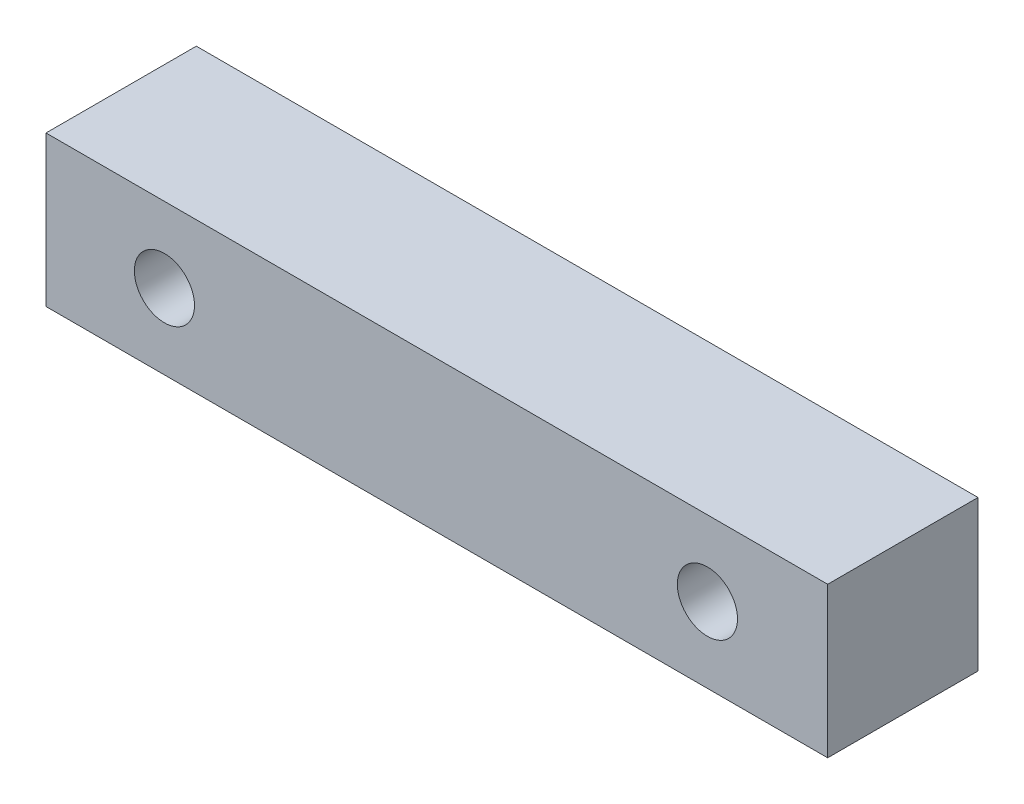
from build123d import *

# Parameters (mm, degrees)
SKETCH1_W           = 26
SKETCH1_H           = 5
BOSS_EXTRUDE1_DEPTH = 5
SKETCH2_R           = 1
CUT_EXTRUDE1_DEPTH  = 5


with BuildPart() as part:
    # Sketch1 → Boss-Extrude1 (new body)
    with BuildSketch(Plane.XY):
        Rectangle(SKETCH1_W, SKETCH1_H)
    extrude(amount=BOSS_EXTRUDE1_DEPTH)

    # Sketch2 → Cut-Extrude1 (cut)
    with BuildSketch(Plane.XY.offset(5)):
        with Locations((-9.0609, 0)):
            Circle(SKETCH2_R)
        with Locations((9, 0)):
            Circle(SKETCH2_R)
    extrude(amount=-CUT_EXTRUDE1_DEPTH, mode=Mode.SUBTRACT)


solid = part.part
